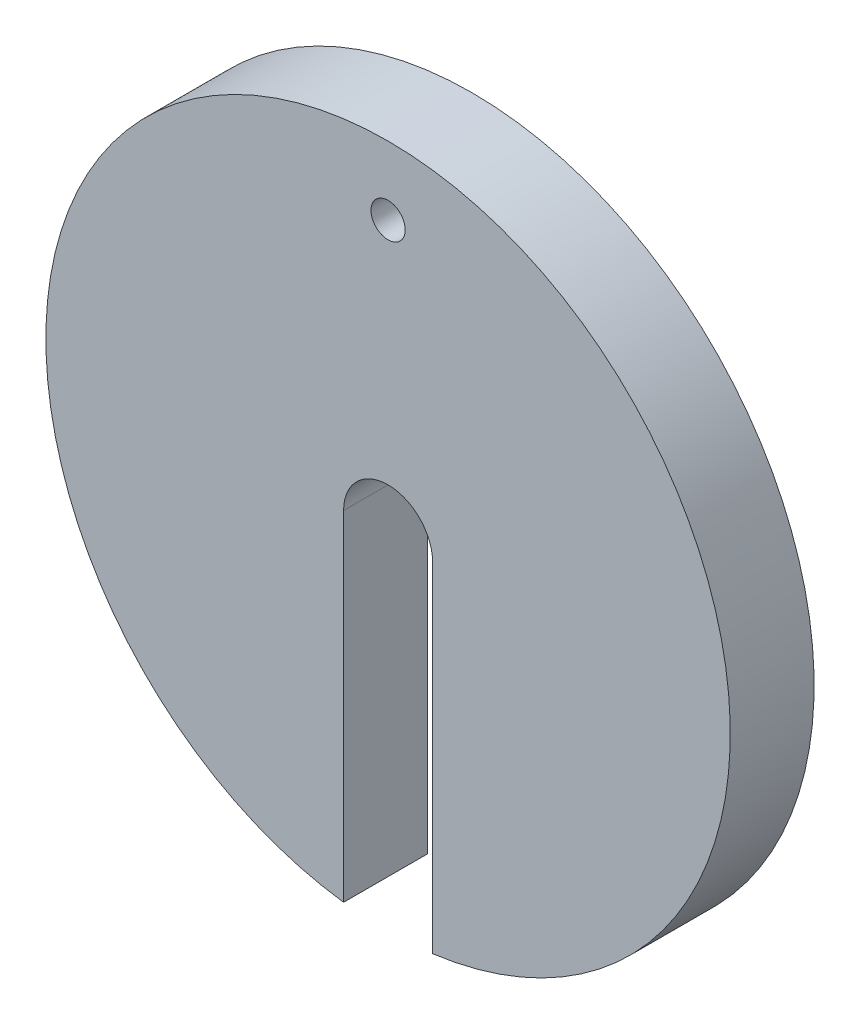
ISO-10303-21;
HEADER;
FILE_DESCRIPTION(('STEP AP214'),'2;1');
FILE_NAME('part.step','',(''),(''),'','','');
FILE_SCHEMA(('AUTOMOTIVE_DESIGN { 1 0 10303 214 1 1 1 1 }'));
ENDSEC;
DATA;
#1=APPLICATION_CONTEXT('core data for automotive mechanical design processes');
#2=APPLICATION_PROTOCOL_DEFINITION('international standard','automotive_design',2000,#1);
#3=PRODUCT_CONTEXT('',#1,'mechanical');
#4=PRODUCT('Part','Part','',(#3));
#5=PRODUCT_RELATED_PRODUCT_CATEGORY('part','',(#4));
#6=PRODUCT_DEFINITION_FORMATION('','',#4);
#7=PRODUCT_DEFINITION_CONTEXT('part definition',#1,'design');
#8=PRODUCT_DEFINITION('design','',#6,#7);
#9=PRODUCT_DEFINITION_SHAPE('','',#8);
#10=(LENGTH_UNIT() NAMED_UNIT(*) SI_UNIT(.MILLI.,.METRE.));
#11=(NAMED_UNIT(*) PLANE_ANGLE_UNIT() SI_UNIT($,.RADIAN.));
#12=(NAMED_UNIT(*) SI_UNIT($,.STERADIAN.) SOLID_ANGLE_UNIT());
#13=UNCERTAINTY_MEASURE_WITH_UNIT(LENGTH_MEASURE(1.E-05),#10,'distance_accuracy_value','');
#14=(GEOMETRIC_REPRESENTATION_CONTEXT(3) GLOBAL_UNCERTAINTY_ASSIGNED_CONTEXT((#13)) GLOBAL_UNIT_ASSIGNED_CONTEXT((#10,
#11,#12)) REPRESENTATION_CONTEXT('',''));
#15=CARTESIAN_POINT('',(0.,0.,0.));
#16=DIRECTION('',(0.,0.,1.));
#17=DIRECTION('',(1.,0.,0.));
#18=AXIS2_PLACEMENT_3D('',#15,#16,#17);
#19=CARTESIAN_POINT('',(0.,0.,12.25));
#20=DIRECTION('',(0.,0.,1.));
#21=DIRECTION('',(1.,0.,0.));
#22=AXIS2_PLACEMENT_3D('',#19,#20,#21);
#23=PLANE('',#22);
#24=CARTESIAN_POINT('',(0.,0.,12.25));
#25=DIRECTION('',(0.,0.,-1.));
#26=DIRECTION('',(1.,0.,0.));
#27=AXIS2_PLACEMENT_3D('',#24,#25,#26);
#28=CIRCLE('',#27,6.5);
#29=CARTESIAN_POINT('',(-6.5,0.,12.25));
#30=VERTEX_POINT('',#29);
#31=CARTESIAN_POINT('',(6.5,0.,12.25));
#32=VERTEX_POINT('',#31);
#33=EDGE_CURVE('E103',#30,#32,#28,.T.);
#34=ORIENTED_EDGE('',*,*,#33,.T.);
#35=DIRECTION('',(0.,-1.,0.));
#36=VECTOR('',#35,1.);
#37=CARTESIAN_POINT('',(6.5,0.,12.25));
#38=LINE('',#37,#36);
#39=CARTESIAN_POINT('',(6.50000000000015,-49.5756996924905,12.25));
#40=VERTEX_POINT('',#39);
#41=EDGE_CURVE('E88',#32,#40,#38,.T.);
#42=ORIENTED_EDGE('',*,*,#41,.T.);
#43=CARTESIAN_POINT('',(0.,0.,12.25));
#44=DIRECTION('',(0.,0.,1.));
#45=DIRECTION('',(1.,0.,0.));
#46=AXIS2_PLACEMENT_3D('',#43,#44,#45);
#47=CIRCLE('',#46,50.);
#48=CARTESIAN_POINT('',(-6.5,-49.5756996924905,12.25));
#49=VERTEX_POINT('',#48);
#50=EDGE_CURVE('E54',#40,#49,#47,.T.);
#51=ORIENTED_EDGE('',*,*,#50,.T.);
#52=DIRECTION('',(0.,1.,0.));
#53=VECTOR('',#52,1.);
#54=CARTESIAN_POINT('',(-6.5,0.,12.25));
#55=LINE('',#54,#53);
#56=EDGE_CURVE('E49',#49,#30,#55,.T.);
#57=ORIENTED_EDGE('',*,*,#56,.T.);
#58=EDGE_LOOP('',(#34,#42,#51,#57));
#59=FACE_BOUND('',#58,.T.);
#60=CARTESIAN_POINT('',(0.,40.,12.25));
#61=DIRECTION('',(0.,0.,1.));
#62=DIRECTION('',(1.,0.,0.));
#63=AXIS2_PLACEMENT_3D('',#60,#61,#62);
#64=CIRCLE('',#63,2.5);
#65=CARTESIAN_POINT('',(2.5,40.,12.25));
#66=VERTEX_POINT('',#65);
#67=EDGE_CURVE('E93',#66,#66,#64,.T.);
#68=ORIENTED_EDGE('',*,*,#67,.F.);
#69=EDGE_LOOP('',(#68));
#70=FACE_BOUND('',#69,.T.);
#71=ADVANCED_FACE('F34',(#59,#70),#23,.T.);
#72=CARTESIAN_POINT('',(0.,0.,0.));
#73=DIRECTION('',(0.,0.,1.));
#74=DIRECTION('',(1.,0.,0.));
#75=AXIS2_PLACEMENT_3D('',#72,#73,#74);
#76=PLANE('',#75);
#77=CARTESIAN_POINT('',(0.,0.,0.));
#78=DIRECTION('',(0.,0.,-1.));
#79=DIRECTION('',(1.,0.,0.));
#80=AXIS2_PLACEMENT_3D('',#77,#78,#79);
#81=CIRCLE('',#80,6.5);
#82=CARTESIAN_POINT('',(-6.5,0.,0.));
#83=VERTEX_POINT('',#82);
#84=CARTESIAN_POINT('',(6.5,0.,0.));
#85=VERTEX_POINT('',#84);
#86=EDGE_CURVE('E80',#83,#85,#81,.T.);
#87=ORIENTED_EDGE('',*,*,#86,.F.);
#88=DIRECTION('',(0.,1.,0.));
#89=VECTOR('',#88,1.);
#90=CARTESIAN_POINT('',(-6.5,0.,0.));
#91=LINE('',#90,#89);
#92=CARTESIAN_POINT('',(-6.5,-49.5756996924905,0.));
#93=VERTEX_POINT('',#92);
#94=EDGE_CURVE('E101',#93,#83,#91,.T.);
#95=ORIENTED_EDGE('',*,*,#94,.F.);
#96=CARTESIAN_POINT('',(0.,0.,0.));
#97=DIRECTION('',(0.,0.,1.));
#98=DIRECTION('',(1.,0.,0.));
#99=AXIS2_PLACEMENT_3D('',#96,#97,#98);
#100=CIRCLE('',#99,50.);
#101=CARTESIAN_POINT('',(6.50000000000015,-49.5756996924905,0.));
#102=VERTEX_POINT('',#101);
#103=EDGE_CURVE('E81',#102,#93,#100,.T.);
#104=ORIENTED_EDGE('',*,*,#103,.F.);
#105=DIRECTION('',(0.,-1.,0.));
#106=VECTOR('',#105,1.);
#107=CARTESIAN_POINT('',(6.5,0.,0.));
#108=LINE('',#107,#106);
#109=EDGE_CURVE('E75',#85,#102,#108,.T.);
#110=ORIENTED_EDGE('',*,*,#109,.F.);
#111=EDGE_LOOP('',(#87,#95,#104,#110));
#112=FACE_BOUND('',#111,.T.);
#113=CARTESIAN_POINT('',(0.,40.,0.));
#114=DIRECTION('',(0.,0.,1.));
#115=DIRECTION('',(1.,0.,0.));
#116=AXIS2_PLACEMENT_3D('',#113,#114,#115);
#117=CIRCLE('',#116,2.5);
#118=CARTESIAN_POINT('',(2.5,40.,0.));
#119=VERTEX_POINT('',#118);
#120=EDGE_CURVE('E96',#119,#119,#117,.T.);
#121=ORIENTED_EDGE('',*,*,#120,.T.);
#122=EDGE_LOOP('',(#121));
#123=FACE_BOUND('',#122,.T.);
#124=ADVANCED_FACE('F76',(#112,#123),#76,.F.);
#125=CARTESIAN_POINT('',(0.,0.,12.25));
#126=DIRECTION('',(0.,0.,-1.));
#127=DIRECTION('',(-1.,0.,0.));
#128=AXIS2_PLACEMENT_3D('',#125,#126,#127);
#129=CYLINDRICAL_SURFACE('',#128,6.5);
#130=ORIENTED_EDGE('',*,*,#86,.T.);
#131=DIRECTION('',(0.,0.,-1.));
#132=VECTOR('',#131,1.);
#133=CARTESIAN_POINT('',(6.5,0.,12.25));
#134=LINE('',#133,#132);
#135=EDGE_CURVE('E11',#32,#85,#134,.T.);
#136=ORIENTED_EDGE('',*,*,#135,.F.);
#137=ORIENTED_EDGE('',*,*,#33,.F.);
#138=DIRECTION('',(0.,0.,-1.));
#139=VECTOR('',#138,1.);
#140=CARTESIAN_POINT('',(-6.5,0.,12.25));
#141=LINE('',#140,#139);
#142=EDGE_CURVE('E92',#30,#83,#141,.T.);
#143=ORIENTED_EDGE('',*,*,#142,.T.);
#144=EDGE_LOOP('',(#130,#136,#137,#143));
#145=FACE_BOUND('',#144,.T.);
#146=ADVANCED_FACE('F36',(#145),#129,.F.);
#147=CARTESIAN_POINT('',(6.5,0.,12.25));
#148=DIRECTION('',(1.,0.,0.));
#149=DIRECTION('',(0.,1.,0.));
#150=AXIS2_PLACEMENT_3D('',#147,#148,#149);
#151=PLANE('',#150);
#152=ORIENTED_EDGE('',*,*,#109,.T.);
#153=DIRECTION('',(0.,0.,-1.));
#154=VECTOR('',#153,1.);
#155=CARTESIAN_POINT('',(6.50000000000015,-49.5756996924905,12.25));
#156=LINE('',#155,#154);
#157=EDGE_CURVE('E42',#40,#102,#156,.T.);
#158=ORIENTED_EDGE('',*,*,#157,.F.);
#159=ORIENTED_EDGE('',*,*,#41,.F.);
#160=ORIENTED_EDGE('',*,*,#135,.T.);
#161=EDGE_LOOP('',(#152,#158,#159,#160));
#162=FACE_BOUND('',#161,.T.);
#163=ADVANCED_FACE('F87',(#162),#151,.F.);
#164=CARTESIAN_POINT('',(0.,0.,12.25));
#165=DIRECTION('',(0.,0.,-1.));
#166=DIRECTION('',(-1.,0.,0.));
#167=AXIS2_PLACEMENT_3D('',#164,#165,#166);
#168=CYLINDRICAL_SURFACE('',#167,50.);
#169=ORIENTED_EDGE('',*,*,#103,.T.);
#170=DIRECTION('',(0.,0.,-1.));
#171=VECTOR('',#170,1.);
#172=CARTESIAN_POINT('',(-6.5,-49.5756996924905,12.25));
#173=LINE('',#172,#171);
#174=EDGE_CURVE('E109',#49,#93,#173,.T.);
#175=ORIENTED_EDGE('',*,*,#174,.F.);
#176=ORIENTED_EDGE('',*,*,#50,.F.);
#177=ORIENTED_EDGE('',*,*,#157,.T.);
#178=EDGE_LOOP('',(#169,#175,#176,#177));
#179=FACE_BOUND('',#178,.T.);
#180=ADVANCED_FACE('F112',(#179),#168,.T.);
#181=CARTESIAN_POINT('',(-6.5,0.,12.25));
#182=DIRECTION('',(-1.,0.,0.));
#183=DIRECTION('',(0.,0.,1.));
#184=AXIS2_PLACEMENT_3D('',#181,#182,#183);
#185=PLANE('',#184);
#186=ORIENTED_EDGE('',*,*,#94,.T.);
#187=ORIENTED_EDGE('',*,*,#142,.F.);
#188=ORIENTED_EDGE('',*,*,#56,.F.);
#189=ORIENTED_EDGE('',*,*,#174,.T.);
#190=EDGE_LOOP('',(#186,#187,#188,#189));
#191=FACE_BOUND('',#190,.T.);
#192=ADVANCED_FACE('F114',(#191),#185,.F.);
#193=CARTESIAN_POINT('',(0.,40.,12.25));
#194=DIRECTION('',(0.,0.,-1.));
#195=DIRECTION('',(-1.,0.,0.));
#196=AXIS2_PLACEMENT_3D('',#193,#194,#195);
#197=CYLINDRICAL_SURFACE('',#196,2.5);
#198=ORIENTED_EDGE('',*,*,#67,.T.);
#199=EDGE_LOOP('',(#198));
#200=FACE_BOUND('',#199,.T.);
#201=ORIENTED_EDGE('',*,*,#120,.F.);
#202=EDGE_LOOP('',(#201));
#203=FACE_BOUND('',#202,.T.);
#204=ADVANCED_FACE('F120',(#200,#203),#197,.F.);
#205=CLOSED_SHELL('',(#71,#124,#146,#163,#180,#192,#204));
#206=MANIFOLD_SOLID_BREP('B2',#205);
#207=ADVANCED_BREP_SHAPE_REPRESENTATION('',(#18,#206),#14);
#208=SHAPE_DEFINITION_REPRESENTATION(#9,#207);
ENDSEC;
END-ISO-10303-21;
